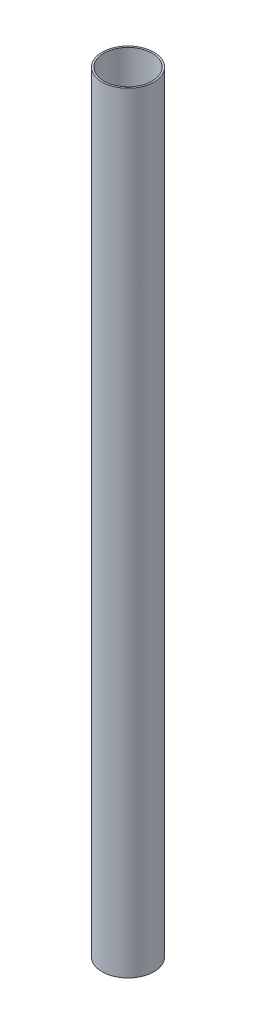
ISO-10303-21;
HEADER;
FILE_DESCRIPTION(('STEP AP214'),'2;1');
FILE_NAME('part.step','',(''),(''),'','','');
FILE_SCHEMA(('AUTOMOTIVE_DESIGN { 1 0 10303 214 1 1 1 1 }'));
ENDSEC;
DATA;
#1=APPLICATION_CONTEXT('core data for automotive mechanical design processes');
#2=APPLICATION_PROTOCOL_DEFINITION('international standard','automotive_design',2000,#1);
#3=PRODUCT_CONTEXT('',#1,'mechanical');
#4=PRODUCT('Part','Part','',(#3));
#5=PRODUCT_RELATED_PRODUCT_CATEGORY('part','',(#4));
#6=PRODUCT_DEFINITION_FORMATION('','',#4);
#7=PRODUCT_DEFINITION_CONTEXT('part definition',#1,'design');
#8=PRODUCT_DEFINITION('design','',#6,#7);
#9=PRODUCT_DEFINITION_SHAPE('','',#8);
#10=(LENGTH_UNIT() NAMED_UNIT(*) SI_UNIT(.MILLI.,.METRE.));
#11=(NAMED_UNIT(*) PLANE_ANGLE_UNIT() SI_UNIT($,.RADIAN.));
#12=(NAMED_UNIT(*) SI_UNIT($,.STERADIAN.) SOLID_ANGLE_UNIT());
#13=UNCERTAINTY_MEASURE_WITH_UNIT(LENGTH_MEASURE(1.E-05),#10,'distance_accuracy_value','');
#14=(GEOMETRIC_REPRESENTATION_CONTEXT(3) GLOBAL_UNCERTAINTY_ASSIGNED_CONTEXT((#13)) GLOBAL_UNIT_ASSIGNED_CONTEXT((#10,
#11,#12)) REPRESENTATION_CONTEXT('',''));
#15=CARTESIAN_POINT('',(0.,0.,0.));
#16=DIRECTION('',(0.,0.,1.));
#17=DIRECTION('',(1.,0.,0.));
#18=AXIS2_PLACEMENT_3D('',#15,#16,#17);
#19=CARTESIAN_POINT('',(0.,870.,0.));
#20=DIRECTION('',(0.,1.,0.));
#21=DIRECTION('',(0.,0.,1.));
#22=AXIS2_PLACEMENT_3D('',#19,#20,#21);
#23=PLANE('',#22);
#24=CARTESIAN_POINT('',(0.,870.,0.));
#25=DIRECTION('',(0.,1.,0.));
#26=DIRECTION('',(0.,0.,1.));
#27=AXIS2_PLACEMENT_3D('',#24,#25,#26);
#28=CIRCLE('',#27,30.);
#29=CARTESIAN_POINT('',(0.,870.,30.));
#30=VERTEX_POINT('',#29);
#31=EDGE_CURVE('E145',#30,#30,#28,.T.);
#32=ORIENTED_EDGE('',*,*,#31,.T.);
#33=EDGE_LOOP('',(#32));
#34=FACE_BOUND('',#33,.T.);
#35=CARTESIAN_POINT('',(0.,870.,0.));
#36=DIRECTION('',(0.,1.,0.));
#37=DIRECTION('',(0.,0.,1.));
#38=AXIS2_PLACEMENT_3D('',#35,#36,#37);
#39=CIRCLE('',#38,28.);
#40=CARTESIAN_POINT('',(0.,870.,28.));
#41=VERTEX_POINT('',#40);
#42=EDGE_CURVE('E148',#41,#41,#39,.T.);
#43=ORIENTED_EDGE('',*,*,#42,.F.);
#44=EDGE_LOOP('',(#43));
#45=FACE_BOUND('',#44,.T.);
#46=ADVANCED_FACE('F35',(#34,#45),#23,.T.);
#47=CARTESIAN_POINT('',(0.,870.,0.));
#48=DIRECTION('',(0.,-1.,0.));
#49=DIRECTION('',(0.,0.,-1.));
#50=AXIS2_PLACEMENT_3D('',#47,#48,#49);
#51=CYLINDRICAL_SURFACE('',#50,30.);
#52=CARTESIAN_POINT('',(-30.,102.5,0.));
#53=CARTESIAN_POINT('',(-30.0000009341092,102.499997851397,-0.139438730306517));
#54=CARTESIAN_POINT('',(-29.9990260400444,102.505834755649,-0.27884837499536));
#55=CARTESIAN_POINT('',(-29.9951557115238,102.529134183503,-0.556708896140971));
#56=CARTESIAN_POINT('',(-29.9922598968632,102.546599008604,-0.69515957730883));
#57=CARTESIAN_POINT('',(-29.9846251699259,102.593038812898,-0.970150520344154));
#58=CARTESIAN_POINT('',(-29.979885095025,102.622021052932,-1.10668952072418));
#59=CARTESIAN_POINT('',(-29.9686930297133,102.691286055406,-1.37685247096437));
#60=CARTESIAN_POINT('',(-29.9622404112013,102.731572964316,-1.51047533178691));
#61=CARTESIAN_POINT('',(-29.9478128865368,102.823085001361,-1.77365528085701));
#62=CARTESIAN_POINT('',(-29.9398398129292,102.874296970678,-1.90321704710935));
#63=CARTESIAN_POINT('',(-29.9225843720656,102.987331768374,-2.15759207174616));
#64=CARTESIAN_POINT('',(-29.9133015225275,103.049158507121,-2.28240355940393));
#65=CARTESIAN_POINT('',(-29.8936901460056,103.182931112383,-2.52631223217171));
#66=CARTESIAN_POINT('',(-29.8833621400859,103.254871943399,-2.64541222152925));
#67=CARTESIAN_POINT('',(-29.8619368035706,103.408417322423,-2.87720075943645));
#68=CARTESIAN_POINT('',(-29.8508391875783,103.490025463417,-2.98988690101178));
#69=CARTESIAN_POINT('',(-29.8280901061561,103.66302595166,-3.20893550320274));
#70=CARTESIAN_POINT('',(-29.8164348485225,103.754492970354,-3.31523860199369));
#71=CARTESIAN_POINT('',(-29.792977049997,103.946055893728,-3.51981905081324));
#72=CARTESIAN_POINT('',(-29.7811744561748,104.04615498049,-3.6180934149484));
#73=CARTESIAN_POINT('',(-29.757760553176,104.254234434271,-3.80586900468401));
#74=CARTESIAN_POINT('',(-29.7461491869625,104.362212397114,-3.89537288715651));
#75=CARTESIAN_POINT('',(-29.7234367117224,104.58537924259,-4.06505128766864));
#76=CARTESIAN_POINT('',(-29.7123357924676,104.700570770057,-4.14522235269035));
#77=CARTESIAN_POINT('',(-29.6909016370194,104.938028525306,-4.29606801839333));
#78=CARTESIAN_POINT('',(-29.6805732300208,105.060331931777,-4.36668480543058));
#79=CARTESIAN_POINT('',(-29.6610510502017,105.310589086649,-4.49737903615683));
#80=CARTESIAN_POINT('',(-29.6518577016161,105.438544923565,-4.55745254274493));
#81=CARTESIAN_POINT('',(-29.6348831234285,105.699119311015,-4.66655756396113));
#82=CARTESIAN_POINT('',(-29.6271012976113,105.831735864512,-4.7155937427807));
#83=CARTESIAN_POINT('',(-29.6131700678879,106.100732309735,-4.80229722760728));
#84=CARTESIAN_POINT('',(-29.6070212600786,106.237113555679,-4.83996038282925));
#85=CARTESIAN_POINT('',(-29.5914227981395,106.647801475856,-4.93477467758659));
#86=CARTESIAN_POINT('',(-29.5846386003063,106.92636886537,-4.97488357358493));
#87=CARTESIAN_POINT('',(-29.5790755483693,107.486203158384,-5.00784793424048));
#88=CARTESIAN_POINT('',(-29.5802961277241,107.767469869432,-5.00070674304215));
#89=CARTESIAN_POINT('',(-29.590529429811,108.321844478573,-4.93978637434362));
#90=CARTESIAN_POINT('',(-29.5994616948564,108.59500659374,-4.88648873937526));
#91=CARTESIAN_POINT('',(-29.6239896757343,109.128445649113,-4.73550730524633));
#92=CARTESIAN_POINT('',(-29.6395856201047,109.388722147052,-4.63782198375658));
#93=CARTESIAN_POINT('',(-29.6757696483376,109.890456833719,-4.40035421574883));
#94=CARTESIAN_POINT('',(-29.6963813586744,110.131818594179,-4.2603717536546));
#95=CARTESIAN_POINT('',(-29.7402583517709,110.587809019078,-3.94242410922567));
#96=CARTESIAN_POINT('',(-29.7635238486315,110.802435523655,-3.76445586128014));
#97=CARTESIAN_POINT('',(-29.8104405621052,111.201652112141,-3.37296440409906));
#98=CARTESIAN_POINT('',(-29.8340929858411,111.38583702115,-3.15902792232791));
#99=CARTESIAN_POINT('',(-29.8788520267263,111.715755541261,-2.70307050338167));
#100=CARTESIAN_POINT('',(-29.8999586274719,111.861488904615,-2.46104938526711));
#101=CARTESIAN_POINT('',(-29.9372778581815,112.11040445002,-1.95541183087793));
#102=CARTESIAN_POINT('',(-29.9534863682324,112.213550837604,-1.6917774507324));
#103=CARTESIAN_POINT('',(-29.9791500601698,112.37398843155,-1.15059669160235));
#104=CARTESIAN_POINT('',(-29.988605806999,112.431283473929,-0.873051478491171));
#105=CARTESIAN_POINT('',(-29.999622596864,112.497842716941,-0.315419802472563));
#106=CARTESIAN_POINT('',(-30.0012750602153,112.507663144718,-0.0354014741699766));
#107=CARTESIAN_POINT('',(-29.9967494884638,112.480477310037,0.522279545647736));
#108=CARTESIAN_POINT('',(-29.9905717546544,112.443472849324,0.799942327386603));
#109=CARTESIAN_POINT('',(-29.971136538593,112.324150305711,1.3433123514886));
#110=CARTESIAN_POINT('',(-29.9579220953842,112.242107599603,1.60908173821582));
#111=CARTESIAN_POINT('',(-29.9258892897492,112.035330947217,2.12309376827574));
#112=CARTESIAN_POINT('',(-29.9070706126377,111.910594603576,2.37133542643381));
#113=CARTESIAN_POINT('',(-29.8656903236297,111.620697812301,2.84566138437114));
#114=CARTESIAN_POINT('',(-29.8430971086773,111.455189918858,3.07153052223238));
#115=CARTESIAN_POINT('',(-29.7967693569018,111.088925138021,3.49248715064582));
#116=CARTESIAN_POINT('',(-29.7730347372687,110.88816569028,3.68757240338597));
#117=CARTESIAN_POINT('',(-29.7268034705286,110.454605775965,4.04348563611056));
#118=CARTESIAN_POINT('',(-29.7043221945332,110.221494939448,4.20393781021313));
#119=CARTESIAN_POINT('',(-29.6634307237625,109.73129079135,4.48340433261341));
#120=CARTESIAN_POINT('',(-29.6450203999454,109.474198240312,4.60241999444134));
#121=CARTESIAN_POINT('',(-29.6144685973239,108.944432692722,4.79507773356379));
#122=CARTESIAN_POINT('',(-29.602301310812,108.671829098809,4.86890685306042));
#123=CARTESIAN_POINT('',(-29.5855561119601,108.117714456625,4.96966691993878));
#124=CARTESIAN_POINT('',(-29.580977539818,107.836204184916,4.99660194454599));
#125=CARTESIAN_POINT('',(-29.5801885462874,107.415590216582,5.0012321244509));
#126=CARTESIAN_POINT('',(-29.5809172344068,107.276463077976,4.99693975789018));
#127=CARTESIAN_POINT('',(-29.5843160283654,106.999087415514,4.97678436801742));
#128=CARTESIAN_POINT('',(-29.5869854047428,106.860838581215,4.96092569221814));
#129=CARTESIAN_POINT('',(-29.5941926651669,106.586152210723,4.91774640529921));
#130=CARTESIAN_POINT('',(-29.5987312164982,106.449715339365,4.89042170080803));
#131=CARTESIAN_POINT('',(-29.6095423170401,106.179703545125,4.82453301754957));
#132=CARTESIAN_POINT('',(-29.615814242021,106.046127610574,4.7859730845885));
#133=CARTESIAN_POINT('',(-29.6299071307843,105.782831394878,4.6979342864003));
#134=CARTESIAN_POINT('',(-29.6377268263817,105.653108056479,4.6484643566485));
#135=CARTESIAN_POINT('',(-29.6546930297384,105.398341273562,4.53896986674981));
#136=CARTESIAN_POINT('',(-29.6638390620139,105.273296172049,4.47894908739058));
#137=CARTESIAN_POINT('',(-29.6832065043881,105.0286385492,4.34874498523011));
#138=CARTESIAN_POINT('',(-29.6934283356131,104.909028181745,4.27855767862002));
#139=CARTESIAN_POINT('',(-29.7146554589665,104.676138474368,4.12855715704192));
#140=CARTESIAN_POINT('',(-29.7256604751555,104.562856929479,4.04874732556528));
#141=CARTESIAN_POINT('',(-29.7482907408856,104.341991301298,3.87899685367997));
#142=CARTESIAN_POINT('',(-29.7599219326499,104.234493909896,3.78894418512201));
#143=CARTESIAN_POINT('',(-29.783347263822,104.027486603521,3.60017574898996));
#144=CARTESIAN_POINT('',(-29.7951413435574,103.927973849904,3.50146308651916));
#145=CARTESIAN_POINT('',(-29.8185735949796,103.737518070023,3.29596225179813));
#146=CARTESIAN_POINT('',(-29.8302116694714,103.646580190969,3.18916929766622));
#147=CARTESIAN_POINT('',(-29.8529952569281,103.474004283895,2.96833108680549));
#148=CARTESIAN_POINT('',(-29.8641409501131,103.392362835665,2.8542885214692));
#149=CARTESIAN_POINT('',(-29.8857116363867,103.238354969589,2.6188382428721));
#150=CARTESIAN_POINT('',(-29.896130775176,103.166060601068,2.49738284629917));
#151=CARTESIAN_POINT('',(-29.9158586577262,103.032003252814,2.24876507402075));
#152=CARTESIAN_POINT('',(-29.925167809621,102.970236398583,2.1216048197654));
#153=CARTESIAN_POINT('',(-29.9424090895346,102.857699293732,1.86251821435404));
#154=CARTESIAN_POINT('',(-29.950342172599,102.806921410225,1.73059524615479));
#155=CARTESIAN_POINT('',(-29.9646113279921,102.716705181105,1.46288984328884));
#156=CARTESIAN_POINT('',(-29.9709477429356,102.677264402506,1.32710824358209));
#157=CARTESIAN_POINT('',(-29.9841083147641,102.59602169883,0.995492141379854));
#158=CARTESIAN_POINT('',(-29.9900398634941,102.560056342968,0.798161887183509));
#159=CARTESIAN_POINT('',(-29.9979850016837,102.512047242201,0.400534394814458));
#160=CARTESIAN_POINT('',(-29.9999986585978,102.500003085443,0.200237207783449));
#161=CARTESIAN_POINT('',(-30.,102.5,0.));
#162=B_SPLINE_CURVE_WITH_KNOTS('',3,(#52,#53,#54,#55,#56,#57,#58,#59,#60,#61,#62,#63,#64,#65,
#66,#67,#68,#69,#70,#71,#72,#73,#74,#75,#76,#77,#78,#79,#80,#81,#82,#83,#84,#85,#86,#87,#88,#89,
#90,#91,#92,#93,#94,#95,#96,#97,#98,#99,#100,#101,#102,#103,#104,#105,#106,#107,#108,#109,#110,
#111,#112,#113,#114,#115,#116,#117,#118,#119,#120,#121,#122,#123,#124,#125,#126,#127,#128,#129,
#130,#131,#132,#133,#134,#135,#136,#137,#138,#139,#140,#141,#142,#143,#144,#145,#146,#147,#148,
#149,#150,#151,#152,#153,#154,#155,#156,#157,#158,#159,#160,#161),.UNSPECIFIED.,.T.,.F.,(4,2,2,
2,2,2,2,2,2,2,2,2,2,2,2,2,2,2,2,2,2,2,2,2,2,2,2,2,2,2,2,2,2,2,2,2,2,2,2,2,2,2,2,2,2,2,2,2,2,2,2,
2,2,2,4),(0.,0.418140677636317,0.836364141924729,1.25485168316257,1.67349292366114,
2.09163274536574,2.50992693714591,2.92801360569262,3.3462561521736,3.76792473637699,
4.18974943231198,4.61144594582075,5.03329798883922,5.45759827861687,5.88205667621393,
6.30633536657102,6.73076871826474,7.57090272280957,8.41097726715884,9.24239161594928,
10.0738344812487,10.9092723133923,11.7447775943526,12.5906365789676,13.4365010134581,
14.2830749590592,15.1295780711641,15.9661388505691,16.8026674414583,17.6341373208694,
18.4656538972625,19.3045176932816,20.1434424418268,20.9910576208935,21.83864592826,
22.6827016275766,23.5266839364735,23.9438629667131,24.3608852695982,24.77805657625,
25.1950778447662,25.611758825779,26.0282907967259,26.4449864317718,26.8615359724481,
27.2831832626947,27.7046799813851,28.1264281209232,28.5480205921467,28.9726903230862,
29.3972034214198,29.8214207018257,30.2455468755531,30.8460167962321,31.4464763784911),.UNSPECIFIED.);
#163=CARTESIAN_POINT('',(-30.,102.5,0.));
#164=VERTEX_POINT('',#163);
#165=EDGE_CURVE('E163',#164,#164,#162,.T.);
#166=ORIENTED_EDGE('',*,*,#165,.T.);
#167=EDGE_LOOP('',(#166));
#168=FACE_BOUND('',#167,.T.);
#169=CARTESIAN_POINT('',(-30.,42.5,0.));
#170=CARTESIAN_POINT('',(-30.0000009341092,42.499997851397,-0.139438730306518));
#171=CARTESIAN_POINT('',(-29.9990260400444,42.5058347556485,-0.278848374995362));
#172=CARTESIAN_POINT('',(-29.9951557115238,42.5291341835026,-0.556708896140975));
#173=CARTESIAN_POINT('',(-29.9922598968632,42.5465990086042,-0.695159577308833));
#174=CARTESIAN_POINT('',(-29.9846251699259,42.5930388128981,-0.970150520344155));
#175=CARTESIAN_POINT('',(-29.979885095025,42.6220210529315,-1.10668952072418));
#176=CARTESIAN_POINT('',(-29.9686930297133,42.6912860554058,-1.37685247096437));
#177=CARTESIAN_POINT('',(-29.9622404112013,42.7315729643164,-1.51047533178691));
#178=CARTESIAN_POINT('',(-29.9478128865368,42.8230850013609,-1.77365528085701));
#179=CARTESIAN_POINT('',(-29.9398398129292,42.8742969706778,-1.90321704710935));
#180=CARTESIAN_POINT('',(-29.9225843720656,42.987331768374,-2.15759207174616));
#181=CARTESIAN_POINT('',(-29.9133015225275,43.0491585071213,-2.28240355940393));
#182=CARTESIAN_POINT('',(-29.8936901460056,43.1829311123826,-2.52631223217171));
#183=CARTESIAN_POINT('',(-29.8833621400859,43.2548719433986,-2.64541222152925));
#184=CARTESIAN_POINT('',(-29.8619368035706,43.4084173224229,-2.87720075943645));
#185=CARTESIAN_POINT('',(-29.8508391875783,43.4900254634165,-2.98988690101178));
#186=CARTESIAN_POINT('',(-29.8280901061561,43.6630259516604,-3.20893550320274));
#187=CARTESIAN_POINT('',(-29.8164348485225,43.7544929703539,-3.3152386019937));
#188=CARTESIAN_POINT('',(-29.792977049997,43.9460558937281,-3.51981905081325));
#189=CARTESIAN_POINT('',(-29.7811744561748,44.0461549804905,-3.6180934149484));
#190=CARTESIAN_POINT('',(-29.757760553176,44.2542344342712,-3.80586900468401));
#191=CARTESIAN_POINT('',(-29.7461491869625,44.362212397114,-3.89537288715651));
#192=CARTESIAN_POINT('',(-29.7234367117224,44.5853792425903,-4.06505128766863));
#193=CARTESIAN_POINT('',(-29.7123357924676,44.7005707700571,-4.14522235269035));
#194=CARTESIAN_POINT('',(-29.6909016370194,44.9380285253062,-4.29606801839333));
#195=CARTESIAN_POINT('',(-29.6805732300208,45.0603319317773,-4.36668480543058));
#196=CARTESIAN_POINT('',(-29.6610510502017,45.3105890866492,-4.49737903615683));
#197=CARTESIAN_POINT('',(-29.6518577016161,45.4385449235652,-4.55745254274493));
#198=CARTESIAN_POINT('',(-29.6348831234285,45.699119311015,-4.66655756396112));
#199=CARTESIAN_POINT('',(-29.6271012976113,45.8317358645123,-4.7155937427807));
#200=CARTESIAN_POINT('',(-29.6131700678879,46.100732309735,-4.80229722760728));
#201=CARTESIAN_POINT('',(-29.6070212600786,46.2371135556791,-4.83996038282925));
#202=CARTESIAN_POINT('',(-29.5914227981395,46.6478014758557,-4.93477467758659));
#203=CARTESIAN_POINT('',(-29.5846386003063,46.9263688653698,-4.97488357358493));
#204=CARTESIAN_POINT('',(-29.5790755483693,47.4862031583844,-5.00784793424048));
#205=CARTESIAN_POINT('',(-29.5802961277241,47.7674698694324,-5.00070674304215));
#206=CARTESIAN_POINT('',(-29.590529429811,48.3218444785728,-4.93978637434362));
#207=CARTESIAN_POINT('',(-29.5994616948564,48.5950065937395,-4.88648873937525));
#208=CARTESIAN_POINT('',(-29.6239896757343,49.1284456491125,-4.73550730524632));
#209=CARTESIAN_POINT('',(-29.6395856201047,49.3887221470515,-4.63782198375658));
#210=CARTESIAN_POINT('',(-29.6757696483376,49.890456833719,-4.40035421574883));
#211=CARTESIAN_POINT('',(-29.6963813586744,50.1318185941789,-4.2603717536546));
#212=CARTESIAN_POINT('',(-29.7402583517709,50.5878090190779,-3.94242410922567));
#213=CARTESIAN_POINT('',(-29.7635238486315,50.8024355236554,-3.76445586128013));
#214=CARTESIAN_POINT('',(-29.8104405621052,51.2016521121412,-3.37296440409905));
#215=CARTESIAN_POINT('',(-29.8340929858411,51.3858370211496,-3.15902792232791));
#216=CARTESIAN_POINT('',(-29.8788520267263,51.7157555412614,-2.70307050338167));
#217=CARTESIAN_POINT('',(-29.8999586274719,51.861488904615,-2.46104938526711));
#218=CARTESIAN_POINT('',(-29.9372778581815,52.1104044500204,-1.95541183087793));
#219=CARTESIAN_POINT('',(-29.9534863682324,52.2135508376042,-1.6917774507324));
#220=CARTESIAN_POINT('',(-29.9791500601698,52.3739884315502,-1.15059669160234));
#221=CARTESIAN_POINT('',(-29.988605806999,52.4312834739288,-0.873051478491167));
#222=CARTESIAN_POINT('',(-29.999622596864,52.4978427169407,-0.315419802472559));
#223=CARTESIAN_POINT('',(-30.0012750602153,52.5076631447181,-0.0354014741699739));
#224=CARTESIAN_POINT('',(-29.9967494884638,52.4804773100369,0.522279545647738));
#225=CARTESIAN_POINT('',(-29.9905717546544,52.4434728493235,0.799942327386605));
#226=CARTESIAN_POINT('',(-29.971136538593,52.3241503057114,1.3433123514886));
#227=CARTESIAN_POINT('',(-29.9579220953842,52.2421075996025,1.60908173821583));
#228=CARTESIAN_POINT('',(-29.9258892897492,52.0353309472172,2.12309376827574));
#229=CARTESIAN_POINT('',(-29.9070706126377,51.9105946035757,2.37133542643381));
#230=CARTESIAN_POINT('',(-29.8656903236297,51.6206978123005,2.84566138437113));
#231=CARTESIAN_POINT('',(-29.8430971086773,51.4551899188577,3.07153052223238));
#232=CARTESIAN_POINT('',(-29.7967693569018,51.0889251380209,3.49248715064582));
#233=CARTESIAN_POINT('',(-29.7730347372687,50.8881656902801,3.68757240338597));
#234=CARTESIAN_POINT('',(-29.7268034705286,50.4546057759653,4.04348563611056));
#235=CARTESIAN_POINT('',(-29.7043221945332,50.2214949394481,4.20393781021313));
#236=CARTESIAN_POINT('',(-29.6634307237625,49.7312907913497,4.48340433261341));
#237=CARTESIAN_POINT('',(-29.6450203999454,49.4741982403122,4.60241999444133));
#238=CARTESIAN_POINT('',(-29.6144685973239,48.9444326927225,4.79507773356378));
#239=CARTESIAN_POINT('',(-29.602301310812,48.6718290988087,4.86890685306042));
#240=CARTESIAN_POINT('',(-29.5855561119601,48.1177144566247,4.96966691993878));
#241=CARTESIAN_POINT('',(-29.580977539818,47.8362041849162,4.99660194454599));
#242=CARTESIAN_POINT('',(-29.5801885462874,47.4155902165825,5.0012321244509));
#243=CARTESIAN_POINT('',(-29.5809172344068,47.2764630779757,4.99693975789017));
#244=CARTESIAN_POINT('',(-29.5843160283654,46.9990874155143,4.97678436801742));
#245=CARTESIAN_POINT('',(-29.5869854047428,46.8608385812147,4.96092569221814));
#246=CARTESIAN_POINT('',(-29.5941926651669,46.5861522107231,4.91774640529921));
#247=CARTESIAN_POINT('',(-29.5987312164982,46.4497153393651,4.89042170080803));
#248=CARTESIAN_POINT('',(-29.6095423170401,46.1797035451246,4.82453301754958));
#249=CARTESIAN_POINT('',(-29.615814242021,46.0461276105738,4.7859730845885));
#250=CARTESIAN_POINT('',(-29.6299071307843,45.7828313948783,4.6979342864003));
#251=CARTESIAN_POINT('',(-29.6377268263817,45.653108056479,4.6484643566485));
#252=CARTESIAN_POINT('',(-29.6546930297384,45.3983412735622,4.53896986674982));
#253=CARTESIAN_POINT('',(-29.6638390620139,45.273296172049,4.47894908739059));
#254=CARTESIAN_POINT('',(-29.6832065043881,45.0286385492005,4.34874498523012));
#255=CARTESIAN_POINT('',(-29.6934283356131,44.9090281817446,4.27855767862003));
#256=CARTESIAN_POINT('',(-29.7146554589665,44.6761384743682,4.12855715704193));
#257=CARTESIAN_POINT('',(-29.7256604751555,44.5628569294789,4.04874732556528));
#258=CARTESIAN_POINT('',(-29.7482907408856,44.3419913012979,3.87899685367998));
#259=CARTESIAN_POINT('',(-29.7599219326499,44.2344939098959,3.78894418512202));
#260=CARTESIAN_POINT('',(-29.783347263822,44.027486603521,3.60017574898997));
#261=CARTESIAN_POINT('',(-29.7951413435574,43.9279738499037,3.50146308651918));
#262=CARTESIAN_POINT('',(-29.8185735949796,43.7375180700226,3.29596225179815));
#263=CARTESIAN_POINT('',(-29.8302116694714,43.6465801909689,3.18916929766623));
#264=CARTESIAN_POINT('',(-29.8529952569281,43.4740042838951,2.9683310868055));
#265=CARTESIAN_POINT('',(-29.8641409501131,43.3923628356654,2.8542885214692));
#266=CARTESIAN_POINT('',(-29.8857116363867,43.2383549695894,2.61883824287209));
#267=CARTESIAN_POINT('',(-29.896130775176,43.1660606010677,2.49738284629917));
#268=CARTESIAN_POINT('',(-29.9158586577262,43.0320032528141,2.24876507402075));
#269=CARTESIAN_POINT('',(-29.925167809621,42.9702363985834,2.1216048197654));
#270=CARTESIAN_POINT('',(-29.9424090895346,42.8576992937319,1.86251821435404));
#271=CARTESIAN_POINT('',(-29.950342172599,42.8069214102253,1.73059524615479));
#272=CARTESIAN_POINT('',(-29.9646113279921,42.7167051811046,1.46288984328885));
#273=CARTESIAN_POINT('',(-29.9709477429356,42.6772644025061,1.32710824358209));
#274=CARTESIAN_POINT('',(-29.9841083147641,42.5960216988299,0.995492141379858));
#275=CARTESIAN_POINT('',(-29.9900398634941,42.5600563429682,0.798161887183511));
#276=CARTESIAN_POINT('',(-29.9979850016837,42.5120472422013,0.400534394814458));
#277=CARTESIAN_POINT('',(-29.9999986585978,42.5000030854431,0.20023720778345));
#278=CARTESIAN_POINT('',(-30.,42.5,0.));
#279=B_SPLINE_CURVE_WITH_KNOTS('',3,(#169,#170,#171,#172,#173,#174,#175,#176,#177,#178,#179,
#180,#181,#182,#183,#184,#185,#186,#187,#188,#189,#190,#191,#192,#193,#194,#195,#196,#197,#198,
#199,#200,#201,#202,#203,#204,#205,#206,#207,#208,#209,#210,#211,#212,#213,#214,#215,#216,#217,
#218,#219,#220,#221,#222,#223,#224,#225,#226,#227,#228,#229,#230,#231,#232,#233,#234,#235,#236,
#237,#238,#239,#240,#241,#242,#243,#244,#245,#246,#247,#248,#249,#250,#251,#252,#253,#254,#255,
#256,#257,#258,#259,#260,#261,#262,#263,#264,#265,#266,#267,#268,#269,#270,#271,#272,#273,#274,
#275,#276,#277,#278),.UNSPECIFIED.,.T.,.F.,(4,2,2,2,2,2,2,2,2,2,2,2,2,2,2,2,2,2,2,2,2,2,2,2,2,2,
2,2,2,2,2,2,2,2,2,2,2,2,2,2,2,2,2,2,2,2,2,2,2,2,2,2,2,2,4),(0.,0.41814067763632,
0.836364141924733,1.25485168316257,1.67349292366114,2.09163274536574,2.50992693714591,
2.92801360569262,3.3462561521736,3.767924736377,4.18974943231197,4.61144594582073,
5.03329798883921,5.45759827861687,5.88205667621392,6.30633536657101,6.73076871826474,
7.57090272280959,8.41097726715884,9.24239161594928,10.0738344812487,10.9092723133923,
11.7447775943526,12.5906365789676,13.4365010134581,14.2830749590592,15.1295780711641,
15.9661388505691,16.8026674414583,17.6341373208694,18.4656538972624,19.3045176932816,
20.1434424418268,20.9910576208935,21.83864592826,22.6827016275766,23.5266839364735,
23.943862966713,24.3608852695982,24.7780565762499,25.1950778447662,25.6117588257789,
26.0282907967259,26.4449864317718,26.861535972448,27.2831832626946,27.7046799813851,
28.1264281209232,28.5480205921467,28.9726903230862,29.3972034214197,29.8214207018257,
30.2455468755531,30.8460167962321,31.446476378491),.UNSPECIFIED.);
#280=CARTESIAN_POINT('',(-30.,42.5,0.));
#281=VERTEX_POINT('',#280);
#282=EDGE_CURVE('E98',#281,#281,#279,.T.);
#283=ORIENTED_EDGE('',*,*,#282,.T.);
#284=EDGE_LOOP('',(#283));
#285=FACE_BOUND('',#284,.T.);
#286=ORIENTED_EDGE('',*,*,#31,.F.);
#287=EDGE_LOOP('',(#286));
#288=FACE_BOUND('',#287,.T.);
#289=DIRECTION('',(0.,-1.,0.));
#290=VECTOR('',#289,1.);
#291=CARTESIAN_POINT('',(-19.2613602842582,870.,-23.));
#292=LINE('',#291,#290);
#293=CARTESIAN_POINT('',(-19.2613602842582,-23.,-23.));
#294=VERTEX_POINT('',#293);
#295=CARTESIAN_POINT('',(-19.2613602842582,4.99999999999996,-23.));
#296=VERTEX_POINT('',#295);
#297=EDGE_CURVE('E57',#294,#296,#292,.F.);
#298=ORIENTED_EDGE('',*,*,#297,.T.);
#299=CARTESIAN_POINT('',(-19.2613602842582,4.99999999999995,-23.));
#300=CARTESIAN_POINT('',(-19.2613276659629,5.26859181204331,-23.0000128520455));
#301=CARTESIAN_POINT('',(-19.2669775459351,5.53717033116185,-22.995295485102));
#302=CARTESIAN_POINT('',(-19.2893994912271,6.07348487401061,-22.9764979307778));
#303=CARTESIAN_POINT('',(-19.3061694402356,6.34122104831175,-22.9624195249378));
#304=CARTESIAN_POINT('',(-19.3505360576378,6.87450281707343,-22.9250419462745));
#305=CARTESIAN_POINT('',(-19.3781068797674,7.14005210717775,-22.9017647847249));
#306=CARTESIAN_POINT('',(-19.4436139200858,7.66889848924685,-22.8461749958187));
#307=CARTESIAN_POINT('',(-19.4815505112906,7.93219549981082,-22.813862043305));
#308=CARTESIAN_POINT('',(-19.6088470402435,8.7102199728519,-22.7047491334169));
#309=CARTESIAN_POINT('',(-19.7123800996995,9.22094698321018,-22.615210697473));
#310=CARTESIAN_POINT('',(-19.9522250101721,10.2279100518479,-22.4038863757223));
#311=CARTESIAN_POINT('',(-20.0885583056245,10.7241363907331,-22.2820793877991));
#312=CARTESIAN_POINT('',(-20.4209512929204,11.8070561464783,-21.9783044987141));
#313=CARTESIAN_POINT('',(-20.6235523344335,12.3896793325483,-21.7889989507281));
#314=CARTESIAN_POINT('',(-21.0583395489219,13.5282385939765,-21.3690812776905));
#315=CARTESIAN_POINT('',(-21.2905317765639,14.0841691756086,-21.1384606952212));
#316=CARTESIAN_POINT('',(-21.7768665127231,15.1720195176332,-20.6371207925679));
#317=CARTESIAN_POINT('',(-22.031127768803,15.703782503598,-20.3661781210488));
#318=CARTESIAN_POINT('',(-22.5526636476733,16.7398013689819,-19.7870974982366));
#319=CARTESIAN_POINT('',(-22.8199373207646,17.2440592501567,-19.4789622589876));
#320=CARTESIAN_POINT('',(-23.3672094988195,18.2363767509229,-18.8191782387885));
#321=CARTESIAN_POINT('',(-23.6473593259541,18.723793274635,-18.4666888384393));
#322=CARTESIAN_POINT('',(-24.2083611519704,19.6693393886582,-17.7248850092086));
#323=CARTESIAN_POINT('',(-24.4892131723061,20.1274680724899,-17.335569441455));
#324=CARTESIAN_POINT('',(-25.0456726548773,21.0126172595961,-16.5214104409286));
#325=CARTESIAN_POINT('',(-25.3212885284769,21.4396914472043,-16.0966311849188));
#326=CARTESIAN_POINT('',(-25.8627230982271,22.2619857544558,-15.2114660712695));
#327=CARTESIAN_POINT('',(-26.128542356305,22.6572077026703,-14.7510822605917));
#328=CARTESIAN_POINT('',(-26.6345719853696,23.3975614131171,-13.8155817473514));
#329=CARTESIAN_POINT('',(-26.8753900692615,23.7441052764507,-13.3419134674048));
#330=CARTESIAN_POINT('',(-27.3393533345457,24.4034818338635,-12.3633699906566));
#331=CARTESIAN_POINT('',(-27.5624982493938,24.716314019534,-11.8584943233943));
#332=CARTESIAN_POINT('',(-27.986779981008,25.3052090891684,-10.819197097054));
#333=CARTESIAN_POINT('',(-28.187926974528,25.581288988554,-10.2847893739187));
#334=CARTESIAN_POINT('',(-28.5641282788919,26.0935928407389,-9.18837740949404));
#335=CARTESIAN_POINT('',(-28.7391869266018,26.3298234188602,-8.62637777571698));
#336=CARTESIAN_POINT('',(-29.0351990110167,26.7268850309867,-7.56399870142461));
#337=CARTESIAN_POINT('',(-29.1603293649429,26.8937106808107,-7.06701821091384));
#338=CARTESIAN_POINT('',(-29.3865737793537,27.1941546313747,-6.05777253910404));
#339=CARTESIAN_POINT('',(-29.4876901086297,27.3277760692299,-5.54550880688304));
#340=CARTESIAN_POINT('',(-29.6638758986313,27.5599478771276,-4.50895483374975));
#341=CARTESIAN_POINT('',(-29.7389589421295,27.658516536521,-3.98467101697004));
#342=CARTESIAN_POINT('',(-29.8615796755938,27.8192165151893,-2.92733277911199));
#343=CARTESIAN_POINT('',(-29.9091170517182,27.8813474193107,-2.39427825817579));
#344=CARTESIAN_POINT('',(-29.9756950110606,27.9683059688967,-1.32180657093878));
#345=CARTESIAN_POINT('',(-29.9946535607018,27.9930262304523,-0.782375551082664));
#346=CARTESIAN_POINT('',(-30.0033841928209,28.0044142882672,0.297127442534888));
#347=CARTESIAN_POINT('',(-29.9931562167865,27.9910820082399,0.837199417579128));
#348=CARTESIAN_POINT('',(-29.9437439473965,27.9265834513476,1.91380017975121));
#349=CARTESIAN_POINT('',(-29.9045560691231,27.875412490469,2.45032851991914));
#350=CARTESIAN_POINT('',(-29.798093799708,27.7360597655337,3.51570857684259));
#351=CARTESIAN_POINT('',(-29.7308197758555,27.6478784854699,4.04456039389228));
#352=CARTESIAN_POINT('',(-29.5730210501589,27.4403189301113,5.06888855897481));
#353=CARTESIAN_POINT('',(-29.4835922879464,27.3224074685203,5.56483349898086));
#354=CARTESIAN_POINT('',(-29.2819513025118,27.0553923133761,6.54346475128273));
#355=CARTESIAN_POINT('',(-29.169739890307,26.9062897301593,7.02615153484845));
#356=CARTESIAN_POINT('',(-28.9244565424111,26.578600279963,7.97599300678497));
#357=CARTESIAN_POINT('',(-28.7913820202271,26.4000097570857,8.44314576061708));
#358=CARTESIAN_POINT('',(-28.5065049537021,26.0151744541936,9.36000419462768));
#359=CARTESIAN_POINT('',(-28.3547012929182,25.8089280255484,9.8097088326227));
#360=CARTESIAN_POINT('',(-28.0177155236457,25.3474764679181,10.7366547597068));
#361=CARTESIAN_POINT('',(-27.8307017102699,25.0894022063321,11.2118012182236));
#362=CARTESIAN_POINT('',(-27.4395943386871,24.5439880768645,12.1375965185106));
#363=CARTESIAN_POINT('',(-27.2354997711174,24.2566464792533,12.5882439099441));
#364=CARTESIAN_POINT('',(-26.8132379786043,23.6546454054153,13.4642789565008));
#365=CARTESIAN_POINT('',(-26.5950643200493,23.3399734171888,13.8896548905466));
#366=CARTESIAN_POINT('',(-26.1478421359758,22.6852147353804,14.7142927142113));
#367=CARTESIAN_POINT('',(-25.9187930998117,22.345126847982,15.1135533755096));
#368=CARTESIAN_POINT('',(-25.406190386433,21.5703089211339,15.9630330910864));
#369=CARTESIAN_POINT('',(-25.1209232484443,21.1302824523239,16.4073987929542));
#370=CARTESIAN_POINT('',(-24.5448102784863,20.2175258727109,17.2573440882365));
#371=CARTESIAN_POINT('',(-24.2539634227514,19.7447897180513,17.6629164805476));
#372=CARTESIAN_POINT('',(-23.672329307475,18.7671294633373,18.4351508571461));
#373=CARTESIAN_POINT('',(-23.381542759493,18.2621592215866,18.8017549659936));
#374=CARTESIAN_POINT('',(-22.8072570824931,17.2212712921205,19.4943906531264));
#375=CARTESIAN_POINT('',(-22.5237565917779,16.6853594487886,19.820429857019));
#376=CARTESIAN_POINT('',(-22.0195782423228,15.6779035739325,20.3777831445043));
#377=CARTESIAN_POINT('',(-21.7965055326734,15.2112239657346,20.6157324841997));
#378=CARTESIAN_POINT('',(-21.3659681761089,14.2566761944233,21.0616098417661));
#379=CARTESIAN_POINT('',(-21.1585037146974,13.7688077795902,21.2695375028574));
#380=CARTESIAN_POINT('',(-20.7662777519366,12.7746896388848,21.6526327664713));
#381=CARTESIAN_POINT('',(-20.5814061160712,12.2685460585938,21.8279616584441));
#382=CARTESIAN_POINT('',(-20.2399824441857,11.2364813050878,22.1449190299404));
#383=CARTESIAN_POINT('',(-20.0834229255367,10.7105654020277,22.2865564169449));
#384=CARTESIAN_POINT('',(-19.8374160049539,9.76259781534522,22.5055007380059));
#385=CARTESIAN_POINT('',(-19.74080213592,9.34409011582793,22.5901122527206));
#386=CARTESIAN_POINT('',(-19.5720910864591,8.4983312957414,22.7364409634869));
#387=CARTESIAN_POINT('',(-19.4999843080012,8.07108366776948,22.7981671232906));
#388=CARTESIAN_POINT('',(-19.3824021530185,7.20527814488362,22.8982225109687));
#389=CARTESIAN_POINT('',(-19.3372274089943,6.76664760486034,22.9362878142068));
#390=CARTESIAN_POINT('',(-19.2918242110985,6.105888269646,22.9744610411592));
#391=CARTESIAN_POINT('',(-19.280416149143,5.88499561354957,22.9840313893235));
#392=CARTESIAN_POINT('',(-19.2651788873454,5.44274558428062,22.9968026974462));
#393=CARTESIAN_POINT('',(-19.2613503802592,5.22138817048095,23.0000030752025));
#394=CARTESIAN_POINT('',(-19.2613602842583,4.99999999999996,23.));
#395=B_SPLINE_CURVE_WITH_KNOTS('',3,(#299,#300,#301,#302,#303,#304,#305,#306,#307,#308,#309,
#310,#311,#312,#313,#314,#315,#316,#317,#318,#319,#320,#321,#322,#323,#324,#325,#326,#327,#328,
#329,#330,#331,#332,#333,#334,#335,#336,#337,#338,#339,#340,#341,#342,#343,#344,#345,#346,#347,
#348,#349,#350,#351,#352,#353,#354,#355,#356,#357,#358,#359,#360,#361,#362,#363,#364,#365,#366,
#367,#368,#369,#370,#371,#372,#373,#374,#375,#376,#377,#378,#379,#380,#381,#382,#383,#384,#385,
#386,#387,#388,#389,#390,#391,#392,#393,#394),.UNSPECIFIED.,.F.,.F.,(4,2,2,2,2,2,2,2,2,2,2,2,2,
2,2,2,2,2,2,2,2,2,2,2,2,2,2,2,2,2,2,2,2,2,2,2,2,2,2,2,2,2,2,2,2,2,2,4),(0.,0.805652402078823,
1.61115152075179,2.41473475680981,3.21834691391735,4.80193302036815,6.38655728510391,
8.31924834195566,10.2523354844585,12.1965589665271,14.1406407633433,16.1296229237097,
18.1186666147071,20.104185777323,22.0895908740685,23.9909593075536,25.89235641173,
27.7928701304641,29.6930675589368,31.3082888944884,32.9233575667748,34.5375823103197,
36.1518254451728,37.7706933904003,39.3895645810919,41.008636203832,42.6276866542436,
44.1786955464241,45.7296492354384,47.2807953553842,48.8320339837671,50.5468043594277,
52.2616761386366,53.9773371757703,55.6930788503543,57.753142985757,59.813588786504,
61.8770532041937,63.9401291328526,65.6469628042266,67.3538167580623,69.0519868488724,
70.7497074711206,72.0617783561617,73.3733347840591,74.6992700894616,75.3632577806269,
76.0273061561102),.UNSPECIFIED.);
#396=CARTESIAN_POINT('',(-19.2613602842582,5.,23.));
#397=VERTEX_POINT('',#396);
#398=EDGE_CURVE('E84',#296,#397,#395,.T.);
#399=ORIENTED_EDGE('',*,*,#398,.T.);
#400=DIRECTION('',(0.,-1.,0.));
#401=VECTOR('',#400,1.);
#402=CARTESIAN_POINT('',(-19.2613602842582,870.,23.));
#403=LINE('',#402,#401);
#404=CARTESIAN_POINT('',(-19.2613602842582,-23.,23.));
#405=VERTEX_POINT('',#404);
#406=EDGE_CURVE('E93',#397,#405,#403,.T.);
#407=ORIENTED_EDGE('',*,*,#406,.T.);
#408=CARTESIAN_POINT('',(0.,-23.,0.));
#409=DIRECTION('',(0.,1.,0.));
#410=DIRECTION('',(0.,0.,1.));
#411=AXIS2_PLACEMENT_3D('',#408,#409,#410);
#412=CIRCLE('',#411,30.);
#413=EDGE_CURVE('E102',#405,#294,#412,.T.);
#414=ORIENTED_EDGE('',*,*,#413,.T.);
#415=EDGE_LOOP('',(#298,#399,#407,#414));
#416=FACE_BOUND('',#415,.T.);
#417=ADVANCED_FACE('F37',(#168,#285,#288,#416),#51,.T.);
#418=CARTESIAN_POINT('',(0.,870.,0.));
#419=DIRECTION('',(0.,-1.,0.));
#420=DIRECTION('',(0.,0.,-1.));
#421=AXIS2_PLACEMENT_3D('',#418,#419,#420);
#422=CYLINDRICAL_SURFACE('',#421,28.);
#423=CARTESIAN_POINT('',(-27.5499546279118,107.5,-5.));
#424=CARTESIAN_POINT('',(-27.5499534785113,107.639267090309,-5.00000235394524));
#425=CARTESIAN_POINT('',(-27.5510126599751,107.778503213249,-4.99417968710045));
#426=CARTESIAN_POINT('',(-27.5552158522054,108.056015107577,-4.97093843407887));
#427=CARTESIAN_POINT('',(-27.558360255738,108.194290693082,-4.95351766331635));
#428=CARTESIAN_POINT('',(-27.5666457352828,108.468924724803,-4.90719805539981));
#429=CARTESIAN_POINT('',(-27.5717879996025,108.605281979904,-4.87829238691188));
#430=CARTESIAN_POINT('',(-27.5839207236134,108.875081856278,-4.80921478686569));
#431=CARTESIAN_POINT('',(-27.5909118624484,109.008523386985,-4.76903871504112));
#432=CARTESIAN_POINT('',(-27.6065289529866,109.271335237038,-4.67778760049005));
#433=CARTESIAN_POINT('',(-27.6151528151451,109.400710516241,-4.62672647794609));
#434=CARTESIAN_POINT('',(-27.6337977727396,109.654723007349,-4.5140316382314));
#435=CARTESIAN_POINT('',(-27.6438193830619,109.779358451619,-4.45239402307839));
#436=CARTESIAN_POINT('',(-27.6649685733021,110.022935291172,-4.31903543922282));
#437=CARTESIAN_POINT('',(-27.6760956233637,110.1418793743,-4.24731929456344));
#438=CARTESIAN_POINT('',(-27.6991524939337,110.3733816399,-4.09425705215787));
#439=CARTESIAN_POINT('',(-27.711082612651,110.485937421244,-4.01290736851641));
#440=CARTESIAN_POINT('',(-27.7355297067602,110.704928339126,-3.84032018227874));
#441=CARTESIAN_POINT('',(-27.7480512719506,110.81129305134,-3.74899395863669));
#442=CARTESIAN_POINT('',(-27.7732247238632,111.016011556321,-3.55770925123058));
#443=CARTESIAN_POINT('',(-27.7858766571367,111.114362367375,-3.45774758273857));
#444=CARTESIAN_POINT('',(-27.810948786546,111.302308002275,-3.24993462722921));
#445=CARTESIAN_POINT('',(-27.8233690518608,111.391905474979,-3.14208574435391));
#446=CARTESIAN_POINT('',(-27.8476400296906,111.561788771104,-2.9191639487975));
#447=CARTESIAN_POINT('',(-27.8594905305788,111.642071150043,-2.80408838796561));
#448=CARTESIAN_POINT('',(-27.8823608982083,111.793211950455,-2.56675882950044));
#449=CARTESIAN_POINT('',(-27.8933748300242,111.864005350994,-2.44446283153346));
#450=CARTESIAN_POINT('',(-27.9141773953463,111.995051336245,-2.19419156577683));
#451=CARTESIAN_POINT('',(-27.9239655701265,112.05529997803,-2.0662141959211));
#452=CARTESIAN_POINT('',(-27.9420285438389,112.164748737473,-1.80556855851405));
#453=CARTESIAN_POINT('',(-27.9503039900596,112.213953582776,-1.67290232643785));
#454=CARTESIAN_POINT('',(-27.9651145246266,112.300983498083,-1.40377971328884));
#455=CARTESIAN_POINT('',(-27.971648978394,112.338804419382,-1.26732197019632));
#456=CARTESIAN_POINT('',(-27.988212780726,112.433978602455,-0.856746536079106));
#457=CARTESIAN_POINT('',(-27.995422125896,112.474330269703,-0.578348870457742));
#458=CARTESIAN_POINT('',(-28.0013939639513,112.507824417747,-0.0188008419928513));
#459=CARTESIAN_POINT('',(-28.0001571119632,112.500970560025,0.262349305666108));
#460=CARTESIAN_POINT('',(-27.9894550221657,112.440692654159,0.816234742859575));
#461=CARTESIAN_POINT('',(-27.9800834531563,112.387798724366,1.0890293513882));
#462=CARTESIAN_POINT('',(-27.9542657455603,112.23776205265,1.6217970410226));
#463=CARTESIAN_POINT('',(-27.9378193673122,112.140617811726,1.88176968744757));
#464=CARTESIAN_POINT('',(-27.8995430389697,111.904327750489,2.383082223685));
#465=CARTESIAN_POINT('',(-27.8776856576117,111.764967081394,2.62431867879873));
#466=CARTESIAN_POINT('',(-27.8310092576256,111.448356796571,3.08018049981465));
#467=CARTESIAN_POINT('',(-27.8061899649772,111.271103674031,3.2948033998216));
#468=CARTESIAN_POINT('',(-27.7559361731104,110.880809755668,3.69448475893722));
#469=CARTESIAN_POINT('',(-27.7304979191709,110.667305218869,3.87909018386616));
#470=CARTESIAN_POINT('',(-27.6822051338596,110.212121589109,4.20993574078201));
#471=CARTESIAN_POINT('',(-27.6593506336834,109.970442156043,4.35617540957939));
#472=CARTESIAN_POINT('',(-27.6188090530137,109.465201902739,4.60624959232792));
#473=CARTESIAN_POINT('',(-27.6011293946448,109.201610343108,4.71002328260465));
#474=CARTESIAN_POINT('',(-27.5730566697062,108.660348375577,4.87168806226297));
#475=CARTESIAN_POINT('',(-27.5626628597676,108.382679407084,4.92958383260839));
#476=CARTESIAN_POINT('',(-27.5504843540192,107.825215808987,4.99719832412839));
#477=CARTESIAN_POINT('',(-27.548583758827,107.545502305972,5.00756567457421));
#478=CARTESIAN_POINT('',(-27.5532973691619,106.988339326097,4.98156323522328));
#479=CARTESIAN_POINT('',(-27.5599111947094,106.71088974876,4.94519553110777));
#480=CARTESIAN_POINT('',(-27.5808008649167,106.168230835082,4.8273105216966));
#481=CARTESIAN_POINT('',(-27.5950197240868,105.902946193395,4.74612886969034));
#482=CARTESIAN_POINT('',(-27.6294688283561,105.389745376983,4.54127465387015));
#483=CARTESIAN_POINT('',(-27.6496994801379,105.141830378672,4.41759921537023));
#484=CARTESIAN_POINT('',(-27.6941590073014,104.667535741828,4.12975876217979));
#485=CARTESIAN_POINT('',(-27.7184277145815,104.441410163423,3.9651813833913));
#486=CARTESIAN_POINT('',(-27.7681148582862,104.019751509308,3.60076821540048));
#487=CARTESIAN_POINT('',(-27.7935333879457,103.824220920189,3.40092956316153));
#488=CARTESIAN_POINT('',(-27.8430261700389,103.466903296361,2.96878356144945));
#489=CARTESIAN_POINT('',(-27.8670805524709,103.305550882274,2.73611425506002));
#490=CARTESIAN_POINT('',(-27.9108069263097,103.024228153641,2.2465826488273));
#491=CARTESIAN_POINT('',(-27.9304790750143,102.904256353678,1.98972121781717));
#492=CARTESIAN_POINT('',(-27.9631406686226,102.709757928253,1.46039089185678));
#493=CARTESIAN_POINT('',(-27.9761623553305,102.63501171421,1.18800455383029));
#494=CARTESIAN_POINT('',(-27.9941852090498,102.532399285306,0.634135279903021));
#495=CARTESIAN_POINT('',(-27.9991871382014,102.504528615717,0.352653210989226));
#496=CARTESIAN_POINT('',(-28.0002663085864,102.498520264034,-0.067839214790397));
#497=CARTESIAN_POINT('',(-27.9995803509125,102.502344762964,-0.20681228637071));
#498=CARTESIAN_POINT('',(-27.9961595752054,102.521539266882,-0.48391933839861));
#499=CARTESIAN_POINT('',(-27.9934255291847,102.536904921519,-0.622053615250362));
#500=CARTESIAN_POINT('',(-27.9859800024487,102.579075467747,-0.896549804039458));
#501=CARTESIAN_POINT('',(-27.9812678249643,102.605884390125,-1.03291107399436));
#502=CARTESIAN_POINT('',(-27.9700002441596,102.670721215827,-1.30281182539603));
#503=CARTESIAN_POINT('',(-27.9634455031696,102.708745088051,-1.43635230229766));
#504=CARTESIAN_POINT('',(-27.9486814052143,102.79568039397,-1.69957891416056));
#505=CARTESIAN_POINT('',(-27.9404739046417,102.844579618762,-1.82926918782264));
#506=CARTESIAN_POINT('',(-27.9226284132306,102.952909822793,-2.08401580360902));
#507=CARTESIAN_POINT('',(-27.9129909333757,103.012337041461,-2.20907378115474));
#508=CARTESIAN_POINT('',(-27.8925423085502,103.141333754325,-2.45380726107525));
#509=CARTESIAN_POINT('',(-27.881730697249,103.210907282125,-2.57348059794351));
#510=CARTESIAN_POINT('',(-27.8592350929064,103.359664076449,-2.80655032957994));
#511=CARTESIAN_POINT('',(-27.8475514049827,103.438843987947,-2.91994889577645));
#512=CARTESIAN_POINT('',(-27.8234642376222,103.60741576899,-3.14124072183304));
#513=CARTESIAN_POINT('',(-27.8110531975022,103.696930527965,-3.24903956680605));
#514=CARTESIAN_POINT('',(-27.7860070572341,103.884639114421,-3.45669611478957));
#515=CARTESIAN_POINT('',(-27.7733720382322,103.98282984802,-3.55655662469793));
#516=CARTESIAN_POINT('',(-27.7482183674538,104.187309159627,-3.74775708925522));
#517=CARTESIAN_POINT('',(-27.7356997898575,104.293602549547,-3.839091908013));
#518=CARTESIAN_POINT('',(-27.7111424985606,104.513472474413,-4.01251176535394));
#519=CARTESIAN_POINT('',(-27.6991036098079,104.627046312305,-4.09460019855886));
#520=CARTESIAN_POINT('',(-27.6757400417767,104.861755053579,-4.24966076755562));
#521=CARTESIAN_POINT('',(-27.6644224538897,104.982946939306,-4.32254776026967));
#522=CARTESIAN_POINT('',(-27.6429489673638,105.231101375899,-4.45780909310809));
#523=CARTESIAN_POINT('',(-27.6327926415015,105.358061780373,-4.52018730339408));
#524=CARTESIAN_POINT('',(-27.6139409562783,105.616820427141,-4.63396076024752));
#525=CARTESIAN_POINT('',(-27.6052446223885,105.748615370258,-4.68536333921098));
#526=CARTESIAN_POINT('',(-27.5895634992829,106.016134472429,-4.77683283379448));
#527=CARTESIAN_POINT('',(-27.5825783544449,106.15185780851,-4.81690210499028));
#528=CARTESIAN_POINT('',(-27.5678768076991,106.486724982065,-4.90048234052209));
#529=CARTESIAN_POINT('',(-27.5611901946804,106.687505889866,-4.93775483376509));
#530=CARTESIAN_POINT('',(-27.5522299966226,107.092213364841,-4.98751165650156));
#531=CARTESIAN_POINT('',(-27.5499563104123,107.296139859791,-4.99999655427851));
#532=CARTESIAN_POINT('',(-27.5499546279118,107.5,-5.));
#533=B_SPLINE_CURVE_WITH_KNOTS('',3,(#423,#424,#425,#426,#427,#428,#429,#430,#431,#432,#433,
#434,#435,#436,#437,#438,#439,#440,#441,#442,#443,#444,#445,#446,#447,#448,#449,#450,#451,#452,
#453,#454,#455,#456,#457,#458,#459,#460,#461,#462,#463,#464,#465,#466,#467,#468,#469,#470,#471,
#472,#473,#474,#475,#476,#477,#478,#479,#480,#481,#482,#483,#484,#485,#486,#487,#488,#489,#490,
#491,#492,#493,#494,#495,#496,#497,#498,#499,#500,#501,#502,#503,#504,#505,#506,#507,#508,#509,
#510,#511,#512,#513,#514,#515,#516,#517,#518,#519,#520,#521,#522,#523,#524,#525,#526,#527,#528,
#529,#530,#531,#532),.UNSPECIFIED.,.T.,.F.,(4,2,2,2,2,2,2,2,2,2,2,2,2,2,2,2,2,2,2,2,2,2,2,2,2,2,
2,2,2,2,2,2,2,2,2,2,2,2,2,2,2,2,2,2,2,2,2,2,2,2,2,2,2,2,4),(0.,0.417622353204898,
0.835323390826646,1.2532732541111,1.67137685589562,2.0889489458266,2.50667526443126,
2.92420231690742,3.34188527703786,3.7636430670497,4.18555706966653,4.60734299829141,
5.02928439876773,5.45398346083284,5.87884098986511,6.30351629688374,6.72834618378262,
7.56810611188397,8.40780090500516,9.23795323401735,10.0681336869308,10.9026121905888,
11.737167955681,12.5833386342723,13.4295195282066,14.276908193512,15.1242103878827,
15.9599141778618,16.7955806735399,17.625071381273,18.4546182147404,19.292894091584,
20.1312380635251,20.9796757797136,21.8280830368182,22.6723371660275,23.5165110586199,
23.9331868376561,24.3497056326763,24.7663712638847,25.1828873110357,25.5989381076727,
26.0148405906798,26.4309088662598,26.8468322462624,27.2683427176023,27.6897034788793,
28.1113164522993,28.5327741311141,28.9578832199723,29.3828354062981,29.8075028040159,
30.2320818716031,30.8434144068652,31.4547329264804),.UNSPECIFIED.);
#534=CARTESIAN_POINT('',(-27.5499546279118,107.5,-5.));
#535=VERTEX_POINT('',#534);
#536=EDGE_CURVE('E40',#535,#535,#533,.T.);
#537=ORIENTED_EDGE('',*,*,#536,.F.);
#538=EDGE_LOOP('',(#537));
#539=FACE_BOUND('',#538,.T.);
#540=CARTESIAN_POINT('',(-27.5499546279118,47.5,-5.));
#541=CARTESIAN_POINT('',(-27.5499534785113,47.6392670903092,-5.00000235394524));
#542=CARTESIAN_POINT('',(-27.5510126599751,47.7785032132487,-4.99417968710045));
#543=CARTESIAN_POINT('',(-27.5552158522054,48.0560151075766,-4.97093843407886));
#544=CARTESIAN_POINT('',(-27.558360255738,48.1942906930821,-4.95351766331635));
#545=CARTESIAN_POINT('',(-27.5666457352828,48.4689247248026,-4.90719805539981));
#546=CARTESIAN_POINT('',(-27.5717879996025,48.6052819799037,-4.87829238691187));
#547=CARTESIAN_POINT('',(-27.5839207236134,48.8750818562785,-4.80921478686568));
#548=CARTESIAN_POINT('',(-27.5909118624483,49.0085233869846,-4.76903871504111));
#549=CARTESIAN_POINT('',(-27.6065289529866,49.2713352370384,-4.67778760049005));
#550=CARTESIAN_POINT('',(-27.6151528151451,49.4007105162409,-4.62672647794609));
#551=CARTESIAN_POINT('',(-27.6337977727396,49.6547230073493,-4.5140316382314));
#552=CARTESIAN_POINT('',(-27.6438193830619,49.7793584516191,-4.45239402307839));
#553=CARTESIAN_POINT('',(-27.6649685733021,50.0229352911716,-4.31903543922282));
#554=CARTESIAN_POINT('',(-27.6760956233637,50.1418793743,-4.24731929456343));
#555=CARTESIAN_POINT('',(-27.6991524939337,50.3733816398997,-4.09425705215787));
#556=CARTESIAN_POINT('',(-27.711082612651,50.4859374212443,-4.0129073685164));
#557=CARTESIAN_POINT('',(-27.7355297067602,50.7049283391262,-3.84032018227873));
#558=CARTESIAN_POINT('',(-27.7480512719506,50.8112930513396,-3.74899395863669));
#559=CARTESIAN_POINT('',(-27.7732247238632,51.0160115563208,-3.55770925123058));
#560=CARTESIAN_POINT('',(-27.7858766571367,51.1143623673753,-3.45774758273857));
#561=CARTESIAN_POINT('',(-27.810948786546,51.3023080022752,-3.24993462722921));
#562=CARTESIAN_POINT('',(-27.8233690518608,51.3919054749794,-3.14208574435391));
#563=CARTESIAN_POINT('',(-27.8476400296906,51.5617887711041,-2.9191639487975));
#564=CARTESIAN_POINT('',(-27.8594905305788,51.6420711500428,-2.80408838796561));
#565=CARTESIAN_POINT('',(-27.8823608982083,51.7932119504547,-2.56675882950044));
#566=CARTESIAN_POINT('',(-27.8933748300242,51.8640053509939,-2.44446283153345));
#567=CARTESIAN_POINT('',(-27.9141773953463,51.9950513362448,-2.19419156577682));
#568=CARTESIAN_POINT('',(-27.9239655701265,52.0552999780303,-2.06621419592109));
#569=CARTESIAN_POINT('',(-27.9420285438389,52.1647487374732,-1.80556855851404));
#570=CARTESIAN_POINT('',(-27.9503039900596,52.2139535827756,-1.67290232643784));
#571=CARTESIAN_POINT('',(-27.9651145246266,52.3009834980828,-1.40377971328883));
#572=CARTESIAN_POINT('',(-27.971648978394,52.3388044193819,-1.26732197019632));
#573=CARTESIAN_POINT('',(-27.988212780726,52.4339786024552,-0.856746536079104));
#574=CARTESIAN_POINT('',(-27.995422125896,52.4743302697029,-0.578348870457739));
#575=CARTESIAN_POINT('',(-28.0013939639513,52.5078244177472,-0.0188008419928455));
#576=CARTESIAN_POINT('',(-28.0001571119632,52.5009705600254,0.262349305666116));
#577=CARTESIAN_POINT('',(-27.9894550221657,52.4406926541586,0.816234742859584));
#578=CARTESIAN_POINT('',(-27.9800834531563,52.3877987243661,1.08902935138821));
#579=CARTESIAN_POINT('',(-27.9542657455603,52.2377620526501,1.62179704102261));
#580=CARTESIAN_POINT('',(-27.9378193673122,52.1406178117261,1.88176968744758));
#581=CARTESIAN_POINT('',(-27.8995430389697,51.9043277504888,2.38308222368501));
#582=CARTESIAN_POINT('',(-27.8776856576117,51.7649670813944,2.62431867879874));
#583=CARTESIAN_POINT('',(-27.8310092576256,51.4483567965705,3.08018049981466));
#584=CARTESIAN_POINT('',(-27.8061899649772,51.2711036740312,3.2948033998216));
#585=CARTESIAN_POINT('',(-27.7559361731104,50.8808097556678,3.69448475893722));
#586=CARTESIAN_POINT('',(-27.7304979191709,50.6673052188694,3.87909018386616));
#587=CARTESIAN_POINT('',(-27.6822051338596,50.2121215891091,4.20993574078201));
#588=CARTESIAN_POINT('',(-27.6593506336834,49.9704421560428,4.35617540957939));
#589=CARTESIAN_POINT('',(-27.6188090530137,49.4652019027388,4.60624959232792));
#590=CARTESIAN_POINT('',(-27.6011293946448,49.2016103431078,4.71002328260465));
#591=CARTESIAN_POINT('',(-27.5730566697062,48.6603483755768,4.87168806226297));
#592=CARTESIAN_POINT('',(-27.5626628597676,48.3826794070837,4.92958383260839));
#593=CARTESIAN_POINT('',(-27.5504843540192,47.8252158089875,4.99719832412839));
#594=CARTESIAN_POINT('',(-27.548583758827,47.5455023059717,5.00756567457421));
#595=CARTESIAN_POINT('',(-27.5532973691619,46.9883393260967,4.98156323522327));
#596=CARTESIAN_POINT('',(-27.5599111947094,46.7108897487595,4.94519553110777));
#597=CARTESIAN_POINT('',(-27.5808008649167,46.1682308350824,4.8273105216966));
#598=CARTESIAN_POINT('',(-27.5950197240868,45.9029461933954,4.74612886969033));
#599=CARTESIAN_POINT('',(-27.6294688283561,45.3897453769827,4.54127465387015));
#600=CARTESIAN_POINT('',(-27.6496994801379,45.1418303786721,4.41759921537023));
#601=CARTESIAN_POINT('',(-27.6941590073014,44.6675357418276,4.12975876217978));
#602=CARTESIAN_POINT('',(-27.7184277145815,44.4414101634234,3.96518138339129));
#603=CARTESIAN_POINT('',(-27.7681148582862,44.019751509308,3.60076821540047));
#604=CARTESIAN_POINT('',(-27.7935333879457,43.8242209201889,3.40092956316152));
#605=CARTESIAN_POINT('',(-27.8430261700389,43.4669032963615,2.96878356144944));
#606=CARTESIAN_POINT('',(-27.8670805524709,43.3055508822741,2.73611425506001));
#607=CARTESIAN_POINT('',(-27.9108069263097,43.0242281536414,2.24658264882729));
#608=CARTESIAN_POINT('',(-27.9304790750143,42.9042563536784,1.98972121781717));
#609=CARTESIAN_POINT('',(-27.9631406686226,42.7097579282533,1.46039089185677));
#610=CARTESIAN_POINT('',(-27.9761623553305,42.6350117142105,1.18800455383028));
#611=CARTESIAN_POINT('',(-27.9941852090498,42.5323992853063,0.634135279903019));
#612=CARTESIAN_POINT('',(-27.9991871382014,42.5045286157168,0.352653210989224));
#613=CARTESIAN_POINT('',(-28.0002663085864,42.4985202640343,-0.0678392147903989));
#614=CARTESIAN_POINT('',(-27.9995803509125,42.5023447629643,-0.206812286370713));
#615=CARTESIAN_POINT('',(-27.9961595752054,42.5215392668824,-0.483919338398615));
#616=CARTESIAN_POINT('',(-27.9934255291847,42.5369049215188,-0.622053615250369));
#617=CARTESIAN_POINT('',(-27.9859800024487,42.5790754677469,-0.896549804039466));
#618=CARTESIAN_POINT('',(-27.9812678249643,42.6058843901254,-1.03291107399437));
#619=CARTESIAN_POINT('',(-27.9700002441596,42.6707212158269,-1.30281182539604));
#620=CARTESIAN_POINT('',(-27.9634455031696,42.7087450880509,-1.43635230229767));
#621=CARTESIAN_POINT('',(-27.9486814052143,42.7956803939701,-1.69957891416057));
#622=CARTESIAN_POINT('',(-27.9404739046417,42.844579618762,-1.82926918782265));
#623=CARTESIAN_POINT('',(-27.9226284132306,42.9529098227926,-2.08401580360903));
#624=CARTESIAN_POINT('',(-27.9129909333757,43.0123370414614,-2.20907378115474));
#625=CARTESIAN_POINT('',(-27.8925423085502,43.1413337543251,-2.45380726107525));
#626=CARTESIAN_POINT('',(-27.881730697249,43.2109072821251,-2.57348059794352));
#627=CARTESIAN_POINT('',(-27.8592350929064,43.3596640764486,-2.80655032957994));
#628=CARTESIAN_POINT('',(-27.8475514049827,43.4388439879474,-2.91994889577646));
#629=CARTESIAN_POINT('',(-27.8234642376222,43.6074157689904,-3.14124072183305));
#630=CARTESIAN_POINT('',(-27.8110531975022,43.6969305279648,-3.24903956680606));
#631=CARTESIAN_POINT('',(-27.7860070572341,43.8846391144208,-3.45669611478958));
#632=CARTESIAN_POINT('',(-27.7733720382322,43.9828298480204,-3.55655662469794));
#633=CARTESIAN_POINT('',(-27.7482183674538,44.1873091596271,-3.74775708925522));
#634=CARTESIAN_POINT('',(-27.7356997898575,44.2936025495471,-3.83909190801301));
#635=CARTESIAN_POINT('',(-27.7111424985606,44.5134724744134,-4.01251176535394));
#636=CARTESIAN_POINT('',(-27.6991036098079,44.6270463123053,-4.09460019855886));
#637=CARTESIAN_POINT('',(-27.6757400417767,44.8617550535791,-4.24966076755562));
#638=CARTESIAN_POINT('',(-27.6644224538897,44.9829469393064,-4.32254776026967));
#639=CARTESIAN_POINT('',(-27.6429489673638,45.2311013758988,-4.45780909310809));
#640=CARTESIAN_POINT('',(-27.6327926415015,45.3580617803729,-4.52018730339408));
#641=CARTESIAN_POINT('',(-27.6139409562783,45.6168204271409,-4.63396076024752));
#642=CARTESIAN_POINT('',(-27.6052446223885,45.7486153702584,-4.68536333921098));
#643=CARTESIAN_POINT('',(-27.5895634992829,46.016134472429,-4.77683283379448));
#644=CARTESIAN_POINT('',(-27.5825783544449,46.1518578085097,-4.81690210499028));
#645=CARTESIAN_POINT('',(-27.5678768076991,46.4867249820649,-4.90048234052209));
#646=CARTESIAN_POINT('',(-27.5611901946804,46.6875058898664,-4.93775483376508));
#647=CARTESIAN_POINT('',(-27.5522299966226,47.0922133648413,-4.98751165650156));
#648=CARTESIAN_POINT('',(-27.5499563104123,47.2961398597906,-4.99999655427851));
#649=CARTESIAN_POINT('',(-27.5499546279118,47.5,-5.));
#650=B_SPLINE_CURVE_WITH_KNOTS('',3,(#540,#541,#542,#543,#544,#545,#546,#547,#548,#549,#550,
#551,#552,#553,#554,#555,#556,#557,#558,#559,#560,#561,#562,#563,#564,#565,#566,#567,#568,#569,
#570,#571,#572,#573,#574,#575,#576,#577,#578,#579,#580,#581,#582,#583,#584,#585,#586,#587,#588,
#589,#590,#591,#592,#593,#594,#595,#596,#597,#598,#599,#600,#601,#602,#603,#604,#605,#606,#607,
#608,#609,#610,#611,#612,#613,#614,#615,#616,#617,#618,#619,#620,#621,#622,#623,#624,#625,#626,
#627,#628,#629,#630,#631,#632,#633,#634,#635,#636,#637,#638,#639,#640,#641,#642,#643,#644,#645,
#646,#647,#648,#649),.UNSPECIFIED.,.T.,.F.,(4,2,2,2,2,2,2,2,2,2,2,2,2,2,2,2,2,2,2,2,2,2,2,2,2,2,
2,2,2,2,2,2,2,2,2,2,2,2,2,2,2,2,2,2,2,2,2,2,2,2,2,2,2,2,4),(0.,0.417622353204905,
0.835323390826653,1.25327325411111,1.67137685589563,2.08894894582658,2.50667526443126,
2.92420231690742,3.34188527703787,3.7636430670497,4.18555706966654,4.6073429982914,
5.02928439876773,5.45398346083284,5.87884098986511,6.30351629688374,6.72834618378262,
7.56810611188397,8.40780090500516,9.23795323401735,10.0681336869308,10.9026121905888,
11.737167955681,12.5833386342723,13.4295195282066,14.276908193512,15.1242103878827,
15.9599141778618,16.7955806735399,17.625071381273,18.4546182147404,19.292894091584,
20.1312380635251,20.9796757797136,21.8280830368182,22.6723371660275,23.5165110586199,
23.9331868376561,24.3497056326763,24.7663712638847,25.1828873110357,25.5989381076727,
26.0148405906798,26.4309088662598,26.8468322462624,27.2683427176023,27.6897034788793,
28.1113164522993,28.5327741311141,28.9578832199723,29.3828354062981,29.8075028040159,
30.2320818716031,30.8434144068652,31.4547329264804),.UNSPECIFIED.);
#651=CARTESIAN_POINT('',(-27.5499546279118,47.5,-5.));
#652=VERTEX_POINT('',#651);
#653=EDGE_CURVE('E127',#652,#652,#650,.T.);
#654=ORIENTED_EDGE('',*,*,#653,.F.);
#655=EDGE_LOOP('',(#654));
#656=FACE_BOUND('',#655,.T.);
#657=DIRECTION('',(0.,-1.,0.));
#658=VECTOR('',#657,1.);
#659=CARTESIAN_POINT('',(-15.9687194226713,870.,23.));
#660=LINE('',#659,#658);
#661=CARTESIAN_POINT('',(-15.9687194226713,5.,23.));
#662=VERTEX_POINT('',#661);
#663=CARTESIAN_POINT('',(-15.9687194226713,-23.,23.));
#664=VERTEX_POINT('',#663);
#665=EDGE_CURVE('E65',#662,#664,#660,.T.);
#666=ORIENTED_EDGE('',*,*,#665,.F.);
#667=CARTESIAN_POINT('',(-15.9687194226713,4.99999999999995,-23.));
#668=CARTESIAN_POINT('',(-15.9687063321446,5.2101597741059,-23.0000036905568));
#669=CARTESIAN_POINT('',(-15.9728702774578,5.42028607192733,-22.9971186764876));
#670=CARTESIAN_POINT('',(-15.9894261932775,5.84002961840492,-22.9856129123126));
#671=CARTESIAN_POINT('',(-16.0018170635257,6.04964693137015,-22.976992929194));
#672=CARTESIAN_POINT('',(-16.0510751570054,6.67629704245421,-22.9426389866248));
#673=CARTESIAN_POINT('',(-16.1000289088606,7.09199510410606,-22.9084106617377));
#674=CARTESIAN_POINT('',(-16.2268022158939,7.91040796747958,-22.8187803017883));
#675=CARTESIAN_POINT('',(-16.3042033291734,8.31322325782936,-22.7636848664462));
#676=CARTESIAN_POINT('',(-16.4845619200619,9.1099247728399,-22.6334171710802));
#677=CARTESIAN_POINT('',(-16.587532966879,9.50380613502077,-22.5582342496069));
#678=CARTESIAN_POINT('',(-16.8587180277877,10.4295672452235,-22.3566984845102));
#679=CARTESIAN_POINT('',(-17.036828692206,10.9566830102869,-22.2217698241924));
#680=CARTESIAN_POINT('',(-17.4247092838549,11.989266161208,-21.9189415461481));
#681=CARTESIAN_POINT('',(-17.63449130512,12.4947251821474,-21.7510293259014));
#682=CARTESIAN_POINT('',(-18.0787432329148,13.4876129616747,-21.3832364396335));
#683=CARTESIAN_POINT('',(-18.3133874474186,13.9748769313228,-21.1831241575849));
#684=CARTESIAN_POINT('',(-18.7987705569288,14.9278284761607,-20.753586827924));
#685=CARTESIAN_POINT('',(-19.0495092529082,15.3935163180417,-20.5241621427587));
#686=CARTESIAN_POINT('',(-19.6661543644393,16.4908811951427,-19.9371548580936));
#687=CARTESIAN_POINT('',(-20.0371122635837,17.1122884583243,-19.56560581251));
#688=CARTESIAN_POINT('',(-20.786108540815,18.3147710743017,-18.7679909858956));
#689=CARTESIAN_POINT('',(-21.1641496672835,18.8958303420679,-18.3419036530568));
#690=CARTESIAN_POINT('',(-21.9158023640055,20.0157982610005,-17.4368293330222));
#691=CARTESIAN_POINT('',(-22.2894214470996,20.5547911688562,-16.9579529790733));
#692=CARTESIAN_POINT('',(-23.0236091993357,21.5897378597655,-15.9468985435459));
#693=CARTESIAN_POINT('',(-23.3841825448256,22.0857071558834,-15.4147398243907));
#694=CARTESIAN_POINT('',(-24.0113481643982,22.9334411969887,-14.4127997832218));
#695=CARTESIAN_POINT('',(-24.2819736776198,23.2938369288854,-13.9528247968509));
#696=CARTESIAN_POINT('',(-24.8052048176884,23.9828460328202,-12.999891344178));
#697=CARTESIAN_POINT('',(-25.057811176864,24.3114606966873,-12.5069342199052));
#698=CARTESIAN_POINT('',(-25.5403032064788,24.9335285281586,-11.4895409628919));
#699=CARTESIAN_POINT('',(-25.7702133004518,25.227019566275,-10.9651396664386));
#700=CARTESIAN_POINT('',(-26.2031224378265,25.7757562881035,-9.88605627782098));
#701=CARTESIAN_POINT('',(-26.4061262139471,26.0310086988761,-9.33137953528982));
#702=CARTESIAN_POINT('',(-26.7491335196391,26.4599575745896,-8.29044061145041));
#703=CARTESIAN_POINT('',(-26.8939867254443,26.6401472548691,-7.80844518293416));
#704=CARTESIAN_POINT('',(-27.1596010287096,26.9693740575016,-6.82745762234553));
#705=CARTESIAN_POINT('',(-27.2803646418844,27.118414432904,-6.32846727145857));
#706=CARTESIAN_POINT('',(-27.4955217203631,27.3832453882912,-5.31637164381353));
#707=CARTESIAN_POINT('',(-27.5899261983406,27.4990498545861,-4.80327236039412));
#708=CARTESIAN_POINT('',(-27.7505380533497,27.6957173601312,-3.76603428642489));
#709=CARTESIAN_POINT('',(-27.8167451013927,27.7765799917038,-3.24189536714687));
#710=CARTESIAN_POINT('',(-27.9197472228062,27.9022616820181,-2.1842844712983));
#711=CARTESIAN_POINT('',(-27.9564238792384,27.946935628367,-1.65078359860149));
#712=CARTESIAN_POINT('',(-27.9990972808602,27.9989058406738,-0.580729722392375));
#713=CARTESIAN_POINT('',(-28.0050939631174,28.0062020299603,-0.044176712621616));
#714=CARTESIAN_POINT('',(-27.9862708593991,27.9832851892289,1.0275715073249));
#715=CARTESIAN_POINT('',(-27.9614514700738,27.9530726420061,1.56276673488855));
#716=CARTESIAN_POINT('',(-27.8815593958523,27.8556804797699,2.62747638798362));
#717=CARTESIAN_POINT('',(-27.8264876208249,27.7885019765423,3.15699098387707));
#718=CARTESIAN_POINT('',(-27.6916719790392,27.6236776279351,4.17342795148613));
#719=CARTESIAN_POINT('',(-27.6136896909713,27.528203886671,4.66094058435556));
#720=CARTESIAN_POINT('',(-27.4336494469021,27.3071565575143,5.62450806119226));
#721=CARTESIAN_POINT('',(-27.3315927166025,27.1815845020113,6.10056348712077));
#722=CARTESIAN_POINT('',(-27.1051279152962,26.9019334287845,7.03882184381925));
#723=CARTESIAN_POINT('',(-26.9807164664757,26.7478501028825,7.50102266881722));
#724=CARTESIAN_POINT('',(-26.7115078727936,26.41295334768,8.40950986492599));
#725=CARTESIAN_POINT('',(-26.5667095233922,26.2321383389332,8.85579529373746));
#726=CARTESIAN_POINT('',(-26.2449763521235,25.8282263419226,9.77019644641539));
#727=CARTESIAN_POINT('',(-26.0663232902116,25.6027904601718,10.2366732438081));
#728=CARTESIAN_POINT('',(-25.6900413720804,25.1246116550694,11.1474030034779));
#729=CARTESIAN_POINT('',(-25.4924115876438,24.8718673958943,11.5916548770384));
#730=CARTESIAN_POINT('',(-25.0809005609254,24.341139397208,12.4570477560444));
#731=CARTESIAN_POINT('',(-24.867015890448,24.0631503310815,12.8781838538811));
#732=CARTESIAN_POINT('',(-24.4257445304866,23.4838366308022,13.6966871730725));
#733=CARTESIAN_POINT('',(-24.1983559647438,23.1825087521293,14.0940510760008));
#734=CARTESIAN_POINT('',(-23.6844776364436,22.4933605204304,14.9445946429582));
#735=CARTESIAN_POINT('',(-23.3955124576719,22.100564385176,15.3922545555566));
#736=CARTESIAN_POINT('',(-22.8065591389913,21.2855318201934,16.2521538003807));
#737=CARTESIAN_POINT('',(-22.5065693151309,20.8632908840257,16.6643876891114));
#738=CARTESIAN_POINT('',(-21.9000243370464,19.9903241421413,17.4538543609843));
#739=CARTESIAN_POINT('',(-21.5934604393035,19.5395586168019,17.8310364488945));
#740=CARTESIAN_POINT('',(-20.9794431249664,18.610967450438,18.5495611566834));
#741=CARTESIAN_POINT('',(-20.671989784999,18.1331440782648,18.8909067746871));
#742=CARTESIAN_POINT('',(-20.070601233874,17.16426359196,19.5283778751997));
#743=CARTESIAN_POINT('',(-19.7765282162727,16.6739479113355,19.8254994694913));
#744=CARTESIAN_POINT('',(-19.1994931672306,15.6672750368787,20.3848195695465));
#745=CARTESIAN_POINT('',(-18.9165333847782,15.1509126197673,20.6470110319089));
#746=CARTESIAN_POINT('',(-18.3701510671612,14.0921858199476,21.134601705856));
#747=CARTESIAN_POINT('',(-18.106700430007,13.5498607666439,21.360054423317));
#748=CARTESIAN_POINT('',(-17.6089432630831,12.4378596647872,21.7722165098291));
#749=CARTESIAN_POINT('',(-17.3746190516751,11.8682005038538,21.9589494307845));
#750=CARTESIAN_POINT('',(-17.0207558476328,10.901948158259,22.2334327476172));
#751=CARTESIAN_POINT('',(-16.8894227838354,10.5130569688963,22.3331593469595));
#752=CARTESIAN_POINT('',(-16.6485940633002,9.72406049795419,22.5132610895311));
#753=CARTESIAN_POINT('',(-16.5390989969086,9.32395491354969,22.5936357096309));
#754=CARTESIAN_POINT('',(-16.3463715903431,8.51531661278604,22.7334624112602));
#755=CARTESIAN_POINT('',(-16.2630499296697,8.10681773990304,22.7929857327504));
#756=CARTESIAN_POINT('',(-16.1259069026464,7.28247953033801,22.8902220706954));
#757=CARTESIAN_POINT('',(-16.0720659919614,6.86664524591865,22.9279495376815));
#758=CARTESIAN_POINT('',(-16.0125764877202,6.20831656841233,22.9695029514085));
#759=CARTESIAN_POINT('',(-15.9961718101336,5.96721587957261,22.9809220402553));
#760=CARTESIAN_POINT('',(-15.974225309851,5.48409123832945,22.9961777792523));
#761=CARTESIAN_POINT('',(-15.96869211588,5.24206670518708,23.0000084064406));
#762=CARTESIAN_POINT('',(-15.9687194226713,5.,23.));
#763=B_SPLINE_CURVE_WITH_KNOTS('',3,(#667,#668,#669,#670,#671,#672,#673,#674,#675,#676,#677,
#678,#679,#680,#681,#682,#683,#684,#685,#686,#687,#688,#689,#690,#691,#692,#693,#694,#695,#696,
#697,#698,#699,#700,#701,#702,#703,#704,#705,#706,#707,#708,#709,#710,#711,#712,#713,#714,#715,
#716,#717,#718,#719,#720,#721,#722,#723,#724,#725,#726,#727,#728,#729,#730,#731,#732,#733,#734,
#735,#736,#737,#738,#739,#740,#741,#742,#743,#744,#745,#746,#747,#748,#749,#750,#751,#752,#753,
#754,#755,#756,#757,#758,#759,#760,#761,#762),.UNSPECIFIED.,.F.,.F.,(4,2,2,2,2,2,2,2,2,2,2,2,2,
2,2,2,2,2,2,2,2,2,2,2,2,2,2,2,2,2,2,2,2,2,2,2,2,2,2,2,2,2,2,2,2,2,2,4),(0.,0.630353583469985,
1.26062288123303,2.51857090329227,3.75871109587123,4.9995108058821,6.71431597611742,
8.42977762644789,10.1581808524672,11.8865627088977,14.3239269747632,16.7622574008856,
19.1955714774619,21.6280044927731,23.5582201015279,25.4883572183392,27.4163941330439,
29.3440914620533,30.9462235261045,32.5481881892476,34.1494825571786,35.7507956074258,
37.3584983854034,38.9662044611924,40.5738898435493,42.1815268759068,43.6884600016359,
45.1953164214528,46.7024007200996,48.2095741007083,49.8521025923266,51.4947114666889,
53.1376677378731,54.7808528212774,56.764886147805,58.7492237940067,60.7363881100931,
62.723386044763,64.6549333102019,66.586869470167,68.5159663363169,70.4438863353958,
71.7101421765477,72.9764322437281,74.2383527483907,75.4994356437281,76.2248869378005,
76.9509137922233),.UNSPECIFIED.);
#764=CARTESIAN_POINT('',(-15.9687194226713,4.99999999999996,-23.));
#765=VERTEX_POINT('',#764);
#766=EDGE_CURVE('E11',#765,#662,#763,.T.);
#767=ORIENTED_EDGE('',*,*,#766,.F.);
#768=DIRECTION('',(0.,-1.,0.));
#769=VECTOR('',#768,1.);
#770=CARTESIAN_POINT('',(-15.9687194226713,870.,-23.));
#771=LINE('',#770,#769);
#772=CARTESIAN_POINT('',(-15.9687194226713,-23.,-23.));
#773=VERTEX_POINT('',#772);
#774=EDGE_CURVE('E97',#773,#765,#771,.F.);
#775=ORIENTED_EDGE('',*,*,#774,.F.);
#776=CARTESIAN_POINT('',(0.,-23.,0.));
#777=DIRECTION('',(0.,1.,0.));
#778=DIRECTION('',(0.,0.,1.));
#779=AXIS2_PLACEMENT_3D('',#776,#777,#778);
#780=CIRCLE('',#779,28.);
#781=EDGE_CURVE('E92',#664,#773,#780,.T.);
#782=ORIENTED_EDGE('',*,*,#781,.F.);
#783=EDGE_LOOP('',(#666,#767,#775,#782));
#784=FACE_BOUND('',#783,.T.);
#785=ORIENTED_EDGE('',*,*,#42,.T.);
#786=EDGE_LOOP('',(#785));
#787=FACE_BOUND('',#786,.T.);
#788=ADVANCED_FACE('F130',(#539,#656,#784,#787),#422,.F.);
#789=CARTESIAN_POINT('',(0.,-23.,0.));
#790=DIRECTION('',(0.,1.,0.));
#791=DIRECTION('',(0.,0.,1.));
#792=AXIS2_PLACEMENT_3D('',#789,#790,#791);
#793=PLANE('',#792);
#794=ORIENTED_EDGE('',*,*,#413,.F.);
#795=DIRECTION('',(1.,0.,0.));
#796=VECTOR('',#795,1.);
#797=CARTESIAN_POINT('',(0.,-23.,23.));
#798=LINE('',#797,#796);
#799=EDGE_CURVE('E49',#405,#664,#798,.T.);
#800=ORIENTED_EDGE('',*,*,#799,.T.);
#801=ORIENTED_EDGE('',*,*,#781,.T.);
#802=DIRECTION('',(-1.,0.,0.));
#803=VECTOR('',#802,1.);
#804=CARTESIAN_POINT('',(0.,-23.,-23.));
#805=LINE('',#804,#803);
#806=EDGE_CURVE('E151',#773,#294,#805,.T.);
#807=ORIENTED_EDGE('',*,*,#806,.T.);
#808=EDGE_LOOP('',(#794,#800,#801,#807));
#809=FACE_BOUND('',#808,.T.);
#810=ADVANCED_FACE('F118',(#809),#793,.F.);
#811=CARTESIAN_POINT('',(-30.,4.99999999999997,0.));
#812=DIRECTION('',(1.,0.,0.));
#813=DIRECTION('',(0.,0.,-1.));
#814=AXIS2_PLACEMENT_3D('',#811,#812,#813);
#815=CYLINDRICAL_SURFACE('',#814,23.);
#816=DIRECTION('',(1.,0.,0.));
#817=VECTOR('',#816,1.);
#818=CARTESIAN_POINT('',(-30.,4.99999999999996,-23.));
#819=LINE('',#818,#817);
#820=EDGE_CURVE('E86',#296,#765,#819,.T.);
#821=ORIENTED_EDGE('',*,*,#820,.T.);
#822=ORIENTED_EDGE('',*,*,#766,.T.);
#823=DIRECTION('',(1.,0.,0.));
#824=VECTOR('',#823,1.);
#825=CARTESIAN_POINT('',(-30.,5.,23.));
#826=LINE('',#825,#824);
#827=EDGE_CURVE('E88',#397,#662,#826,.T.);
#828=ORIENTED_EDGE('',*,*,#827,.F.);
#829=ORIENTED_EDGE('',*,*,#398,.F.);
#830=EDGE_LOOP('',(#821,#822,#828,#829));
#831=FACE_BOUND('',#830,.T.);
#832=ADVANCED_FACE('F85',(#831),#815,.F.);
#833=CARTESIAN_POINT('',(-30.,-30.,23.));
#834=DIRECTION('',(0.,0.,1.));
#835=DIRECTION('',(1.,0.,0.));
#836=AXIS2_PLACEMENT_3D('',#833,#834,#835);
#837=PLANE('',#836);
#838=ORIENTED_EDGE('',*,*,#827,.T.);
#839=ORIENTED_EDGE('',*,*,#665,.T.);
#840=ORIENTED_EDGE('',*,*,#799,.F.);
#841=ORIENTED_EDGE('',*,*,#406,.F.);
#842=EDGE_LOOP('',(#838,#839,#840,#841));
#843=FACE_BOUND('',#842,.T.);
#844=ADVANCED_FACE('F117',(#843),#837,.F.);
#845=CARTESIAN_POINT('',(-30.,-30.,-23.));
#846=DIRECTION('',(0.,0.,-1.));
#847=DIRECTION('',(-1.,0.,0.));
#848=AXIS2_PLACEMENT_3D('',#845,#846,#847);
#849=PLANE('',#848);
#850=ORIENTED_EDGE('',*,*,#806,.F.);
#851=ORIENTED_EDGE('',*,*,#774,.T.);
#852=ORIENTED_EDGE('',*,*,#820,.F.);
#853=ORIENTED_EDGE('',*,*,#297,.F.);
#854=EDGE_LOOP('',(#850,#851,#852,#853));
#855=FACE_BOUND('',#854,.T.);
#856=ADVANCED_FACE('F95',(#855),#849,.F.);
#857=CARTESIAN_POINT('',(-30.,47.5,0.));
#858=DIRECTION('',(1.,0.,0.));
#859=DIRECTION('',(0.,0.,-1.));
#860=AXIS2_PLACEMENT_3D('',#857,#858,#859);
#861=CYLINDRICAL_SURFACE('',#860,5.);
#862=ORIENTED_EDGE('',*,*,#653,.T.);
#863=EDGE_LOOP('',(#862));
#864=FACE_BOUND('',#863,.T.);
#865=ORIENTED_EDGE('',*,*,#282,.F.);
#866=EDGE_LOOP('',(#865));
#867=FACE_BOUND('',#866,.T.);
#868=ADVANCED_FACE('F166',(#864,#867),#861,.F.);
#869=CARTESIAN_POINT('',(-30.,107.5,0.));
#870=DIRECTION('',(1.,0.,0.));
#871=DIRECTION('',(0.,0.,-1.));
#872=AXIS2_PLACEMENT_3D('',#869,#870,#871);
#873=CYLINDRICAL_SURFACE('',#872,5.);
#874=ORIENTED_EDGE('',*,*,#536,.T.);
#875=EDGE_LOOP('',(#874));
#876=FACE_BOUND('',#875,.T.);
#877=ORIENTED_EDGE('',*,*,#165,.F.);
#878=EDGE_LOOP('',(#877));
#879=FACE_BOUND('',#878,.T.);
#880=ADVANCED_FACE('F169',(#876,#879),#873,.F.);
#881=CLOSED_SHELL('',(#46,#417,#788,#810,#832,#844,#856,#868,#880));
#882=MANIFOLD_SOLID_BREP('B2',#881);
#883=ADVANCED_BREP_SHAPE_REPRESENTATION('',(#18,#882),#14);
#884=SHAPE_DEFINITION_REPRESENTATION(#9,#883);
ENDSEC;
END-ISO-10303-21;
